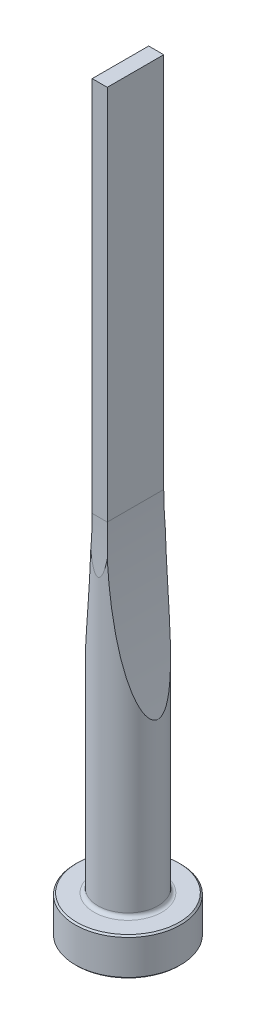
from build123d import *

# Parameters (mm, degrees)
CUT_EXTRUDE1_DEPTH = 5
CUT_EXTRUDE2_DEPTH = 5


with BuildPart() as part:
    # Sketch1 → Revolve1 (revolve)
    with BuildSketch(Plane.XY, mode=Mode.PRIVATE) as revolve1_sk:
        with BuildLine():
            Line((0, 0), (6.8, 0))
            Line((6.8, 0), (7, 0.2))
            Line((7, 0.2), (7, 4.8))
            Line((7, 4.8), (6.8, 5))
            Line((6.8, 5), (4.5, 5))
            ThreePointArc((4.5, 5), (4.146446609, 5.146446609), (4, 5.5))
            Line((4, 5.5), (4, 100))
            Line((4, 100), (0, 100))
            Line((0, 100), (0, 0))
        make_face()
    revolve(revolve1_sk.sketch.rotate(Axis((0, 100, 0), (0, -1, 0)), 180), axis=Axis((0, 100, 0), (0, -1, 0)))

    # Sketch2 → Cut-Extrude1 (cut, symmetric)
    with BuildSketch(Plane.XY):
        with BuildLine():
            Line((1, 100), (1, 50))
            ThreePointArc((1, 50), (1.753151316, 38.381049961), (4, 26.956562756))
            Line((4, 26.956562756), (4, 100))
            Line((4, 100), (1, 100))
        make_face()
        with BuildLine():
            Line((-1, 100), (-1, 50))
            ThreePointArc((-1, 50), (-1.753151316, 38.381049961), (-4, 26.956562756))
            Line((-4, 26.956562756), (-4, 100))
            Line((-4, 100), (-1, 100))
        make_face()
    extrude(amount=CUT_EXTRUDE1_DEPTH, both=True, mode=Mode.SUBTRACT)

    # Sketch3 → Cut-Extrude2 (cut, symmetric)
    with BuildSketch(Plane(origin=(0, 0, 0), x_dir=(0, 0, -1), z_dir=(1, 0, 0))):
        with BuildLine():
            Line((3.75, 100), (3.75, 50))
            ThreePointArc((3.75, 50), (3.812521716, 46.645898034), (4, 43.296456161))
            Line((4, 43.296456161), (4, 100))
            Line((4, 100), (3.75, 100))
        make_face()
        with BuildLine():
            Line((-3.75, 100), (-3.75, 50))
            ThreePointArc((-3.75, 50), (-3.812521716, 46.645898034), (-4, 43.296456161))
            Line((-4, 43.296456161), (-4, 100))
            Line((-4, 100), (-3.75, 100))
        make_face()
    extrude(amount=CUT_EXTRUDE2_DEPTH, both=True, mode=Mode.SUBTRACT)


solid = part.part
